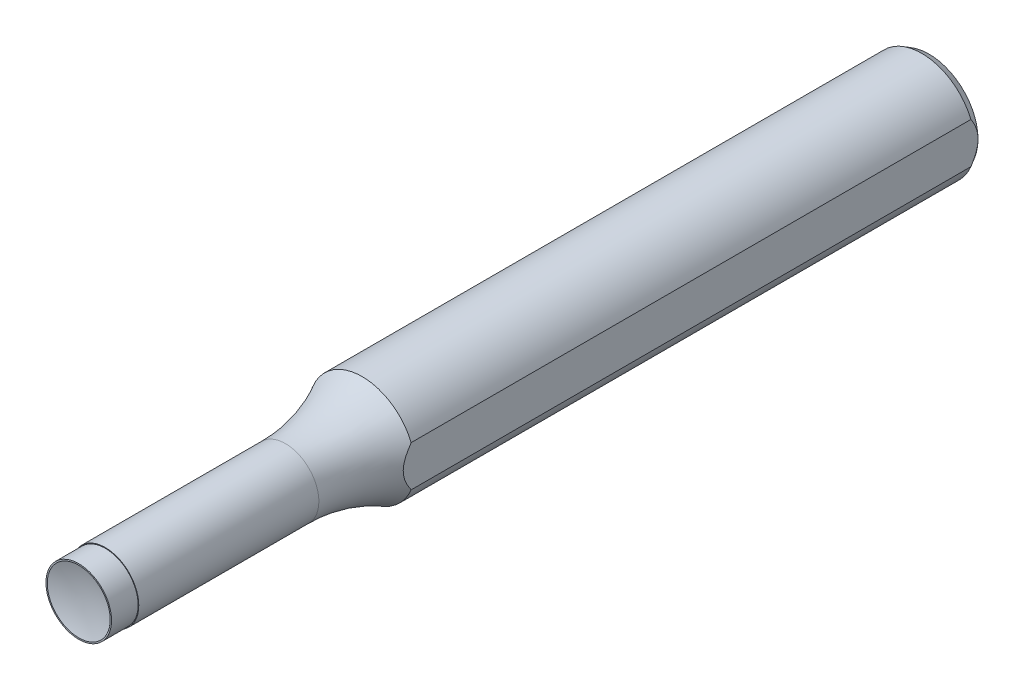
ISO-10303-21;
HEADER;
FILE_DESCRIPTION(('STEP AP214'),'2;1');
FILE_NAME('part.step','',(''),(''),'','','');
FILE_SCHEMA(('AUTOMOTIVE_DESIGN { 1 0 10303 214 1 1 1 1 }'));
ENDSEC;
DATA;
#1=APPLICATION_CONTEXT('core data for automotive mechanical design processes');
#2=APPLICATION_PROTOCOL_DEFINITION('international standard','automotive_design',2000,#1);
#3=PRODUCT_CONTEXT('',#1,'mechanical');
#4=PRODUCT('Part','Part','',(#3));
#5=PRODUCT_RELATED_PRODUCT_CATEGORY('part','',(#4));
#6=PRODUCT_DEFINITION_FORMATION('','',#4);
#7=PRODUCT_DEFINITION_CONTEXT('part definition',#1,'design');
#8=PRODUCT_DEFINITION('design','',#6,#7);
#9=PRODUCT_DEFINITION_SHAPE('','',#8);
#10=(LENGTH_UNIT() NAMED_UNIT(*) SI_UNIT(.MILLI.,.METRE.));
#11=(NAMED_UNIT(*) PLANE_ANGLE_UNIT() SI_UNIT($,.RADIAN.));
#12=(NAMED_UNIT(*) SI_UNIT($,.STERADIAN.) SOLID_ANGLE_UNIT());
#13=UNCERTAINTY_MEASURE_WITH_UNIT(LENGTH_MEASURE(1.E-05),#10,'distance_accuracy_value','');
#14=(GEOMETRIC_REPRESENTATION_CONTEXT(3) GLOBAL_UNCERTAINTY_ASSIGNED_CONTEXT((#13)) GLOBAL_UNIT_ASSIGNED_CONTEXT((#10,
#11,#12)) REPRESENTATION_CONTEXT('',''));
#15=CARTESIAN_POINT('',(0.,0.,0.));
#16=DIRECTION('',(0.,0.,1.));
#17=DIRECTION('',(1.,0.,0.));
#18=AXIS2_PLACEMENT_3D('',#15,#16,#17);
#19=CARTESIAN_POINT('',(0.,0.,-42.3333333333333));
#20=DIRECTION('',(0.,0.,1.));
#21=DIRECTION('',(1.,0.,0.));
#22=AXIS2_PLACEMENT_3D('',#19,#20,#21);
#23=CYLINDRICAL_SURFACE('',#22,5.);
#24=CARTESIAN_POINT('',(0.,0.,-30.8695643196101));
#25=DIRECTION('',(0.,0.,1.));
#26=DIRECTION('',(0.,-1.,0.));
#27=AXIS2_PLACEMENT_3D('',#24,#25,#26);
#28=CIRCLE('',#27,5.);
#29=CARTESIAN_POINT('',(0.,-5.,-30.8695643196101));
#30=VERTEX_POINT('',#29);
#31=EDGE_CURVE('E79',#30,#30,#28,.F.);
#32=ORIENTED_EDGE('',*,*,#31,.F.);
#33=EDGE_LOOP('',(#32));
#34=FACE_BOUND('',#33,.T.);
#35=CARTESIAN_POINT('',(0.,0.,-3.97));
#36=DIRECTION('',(0.,0.,1.));
#37=DIRECTION('',(1.,0.,0.));
#38=AXIS2_PLACEMENT_3D('',#35,#36,#37);
#39=CIRCLE('',#38,5.);
#40=CARTESIAN_POINT('',(5.,0.,-3.97));
#41=VERTEX_POINT('',#40);
#42=EDGE_CURVE('E90',#41,#41,#39,.F.);
#43=ORIENTED_EDGE('',*,*,#42,.T.);
#44=EDGE_LOOP('',(#43));
#45=FACE_BOUND('',#44,.T.);
#46=ADVANCED_FACE('F42',(#34,#45),#23,.T.);
#47=CARTESIAN_POINT('',(0.,0.,-3.97));
#48=DIRECTION('',(0.,0.,1.));
#49=DIRECTION('',(1.,0.,0.));
#50=AXIS2_PLACEMENT_3D('',#47,#48,#49);
#51=PLANE('',#50);
#52=ORIENTED_EDGE('',*,*,#42,.F.);
#53=EDGE_LOOP('',(#52));
#54=FACE_BOUND('',#53,.T.);
#55=CARTESIAN_POINT('',(0.,0.,-3.97));
#56=DIRECTION('',(0.,0.,1.));
#57=DIRECTION('',(1.,0.,0.));
#58=AXIS2_PLACEMENT_3D('',#55,#56,#57);
#59=CIRCLE('',#58,4.9);
#60=CARTESIAN_POINT('',(4.9,0.,-3.97));
#61=VERTEX_POINT('',#60);
#62=EDGE_CURVE('E98',#61,#61,#59,.T.);
#63=ORIENTED_EDGE('',*,*,#62,.F.);
#64=EDGE_LOOP('',(#63));
#65=FACE_BOUND('',#64,.T.);
#66=ADVANCED_FACE('F111',(#54,#65),#51,.T.);
#67=CARTESIAN_POINT('',(0.,0.,-3.97));
#68=DIRECTION('',(0.,0.,1.));
#69=DIRECTION('',(1.,0.,0.));
#70=AXIS2_PLACEMENT_3D('',#67,#68,#69);
#71=CYLINDRICAL_SURFACE('',#70,4.9);
#72=ORIENTED_EDGE('',*,*,#62,.T.);
#73=EDGE_LOOP('',(#72));
#74=FACE_BOUND('',#73,.T.);
#75=CARTESIAN_POINT('',(0.,0.,0.));
#76=DIRECTION('',(0.,0.,1.));
#77=DIRECTION('',(1.,0.,0.));
#78=AXIS2_PLACEMENT_3D('',#75,#76,#77);
#79=CIRCLE('',#78,4.9);
#80=CARTESIAN_POINT('',(4.9,0.,0.));
#81=VERTEX_POINT('',#80);
#82=EDGE_CURVE('E122',#81,#81,#79,.T.);
#83=ORIENTED_EDGE('',*,*,#82,.F.);
#84=EDGE_LOOP('',(#83));
#85=FACE_BOUND('',#84,.T.);
#86=ADVANCED_FACE('F117',(#74,#85),#71,.T.);
#87=CARTESIAN_POINT('',(0.,0.,0.));
#88=DIRECTION('',(0.,0.,1.));
#89=DIRECTION('',(1.,0.,0.));
#90=AXIS2_PLACEMENT_3D('',#87,#88,#89);
#91=PLANE('',#90);
#92=CARTESIAN_POINT('',(0.,0.,0.));
#93=DIRECTION('',(0.,0.,1.));
#94=DIRECTION('',(0.,-1.,0.));
#95=AXIS2_PLACEMENT_3D('',#92,#93,#94);
#96=CIRCLE('',#95,4.7);
#97=CARTESIAN_POINT('',(0.,-4.7,0.));
#98=VERTEX_POINT('',#97);
#99=EDGE_CURVE('E126',#98,#98,#96,.T.);
#100=ORIENTED_EDGE('',*,*,#99,.F.);
#101=EDGE_LOOP('',(#100));
#102=FACE_BOUND('',#101,.T.);
#103=ORIENTED_EDGE('',*,*,#82,.T.);
#104=EDGE_LOOP('',(#103));
#105=FACE_BOUND('',#104,.T.);
#106=ADVANCED_FACE('F157',(#102,#105),#91,.T.);
#107=CARTESIAN_POINT('',(0.,0.,15.1685332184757));
#108=DIRECTION('',(0.,0.,1.));
#109=DIRECTION('',(0.,-1.,0.));
#110=AXIS2_PLACEMENT_3D('',#107,#108,#109);
#111=SPHERICAL_SURFACE('',#110,15.88);
#112=ORIENTED_EDGE('',*,*,#99,.T.);
#113=EDGE_LOOP('',(#112));
#114=FACE_BOUND('',#113,.T.);
#115=ADVANCED_FACE('F160',(#114),#111,.F.);
#116=CARTESIAN_POINT('',(0.,0.,-30.8695643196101));
#117=DIRECTION('',(0.,0.,-1.));
#118=DIRECTION('',(0.,1.,0.));
#119=AXIS2_PLACEMENT_3D('',#116,#117,#118);
#120=TOROIDAL_SURFACE('',#119,28.82,23.82);
#121=CARTESIAN_POINT('',(7.32877851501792,16.0454516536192,-51.9028398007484));
#122=CARTESIAN_POINT('',(7.32877851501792,15.7495868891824,-51.7597994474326));
#123=CARTESIAN_POINT('',(7.32877851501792,15.4560685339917,-51.6119350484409));
#124=CARTESIAN_POINT('',(7.32877851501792,14.8738791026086,-51.3070150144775));
#125=CARTESIAN_POINT('',(7.32877851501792,14.5852075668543,-51.1499602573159));
#126=CARTESIAN_POINT('',(7.32877851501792,14.0130794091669,-50.8272410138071));
#127=CARTESIAN_POINT('',(7.32877851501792,13.7296181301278,-50.6615847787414));
#128=CARTESIAN_POINT('',(7.32877851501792,13.1676921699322,-50.3220159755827));
#129=CARTESIAN_POINT('',(7.32877851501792,12.8892275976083,-50.1481032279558));
#130=CARTESIAN_POINT('',(7.32877851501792,12.0672388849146,-49.6185163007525));
#131=CARTESIAN_POINT('',(7.32877851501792,11.5309659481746,-49.2514993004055));
#132=CARTESIAN_POINT('',(7.32877851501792,10.7406702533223,-48.6815621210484));
#133=CARTESIAN_POINT('',(7.32877851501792,10.4795599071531,-48.4883232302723));
#134=CARTESIAN_POINT('',(7.32877851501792,9.96175883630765,-48.0960028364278));
#135=CARTESIAN_POINT('',(7.32877851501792,9.70506808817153,-47.8969213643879));
#136=CARTESIAN_POINT('',(7.32877851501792,9.09926807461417,-47.4171987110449));
#137=CARTESIAN_POINT('',(7.32877851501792,8.75199772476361,-47.1342387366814));
#138=CARTESIAN_POINT('',(7.32877851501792,8.06388202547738,-46.5606926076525));
#139=CARTESIAN_POINT('',(7.32877851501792,7.72303627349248,-46.2701069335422));
#140=CARTESIAN_POINT('',(7.32877851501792,7.21437876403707,-45.830020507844));
#141=CARTESIAN_POINT('',(7.32877851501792,7.04496501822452,-45.6823595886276));
#142=CARTESIAN_POINT('',(7.32877851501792,6.70684504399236,-45.3862358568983));
#143=CARTESIAN_POINT('',(7.32877851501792,6.53813880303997,-45.2377730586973));
#144=CARTESIAN_POINT('',(7.32877851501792,6.20101799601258,-44.9405677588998));
#145=CARTESIAN_POINT('',(7.32877851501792,6.03260339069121,-44.7918253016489));
#146=CARTESIAN_POINT('',(7.32877851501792,5.69547952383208,-44.4946498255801));
#147=CARTESIAN_POINT('',(7.32877851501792,5.52677024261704,-44.3462168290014));
#148=CARTESIAN_POINT('',(7.32877851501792,5.12188932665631,-43.9922970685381));
#149=CARTESIAN_POINT('',(7.32877851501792,4.88527017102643,-43.7873210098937));
#150=CARTESIAN_POINT('',(7.32877851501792,4.40783518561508,-43.3823214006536));
#151=CARTESIAN_POINT('',(7.32877851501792,4.16702004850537,-43.1822970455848));
#152=CARTESIAN_POINT('',(7.32877851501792,3.80040115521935,-42.8895407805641));
#153=CARTESIAN_POINT('',(7.32877851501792,3.67743321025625,-42.793270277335));
#154=CARTESIAN_POINT('',(7.32877851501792,3.42908896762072,-42.6038964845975));
#155=CARTESIAN_POINT('',(7.32877851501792,3.30371289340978,-42.5107929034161));
#156=CARTESIAN_POINT('',(7.32877851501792,3.05006827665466,-42.3288464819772));
#157=CARTESIAN_POINT('',(7.32877851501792,2.92180257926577,-42.2399996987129));
#158=CARTESIAN_POINT('',(7.32877851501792,2.66163518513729,-42.067831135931));
#159=CARTESIAN_POINT('',(7.32877851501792,2.52973441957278,-41.9845079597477));
#160=CARTESIAN_POINT('',(7.32877851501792,2.28701623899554,-41.8402536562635));
#161=CARTESIAN_POINT('',(7.32877851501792,2.17694874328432,-41.7780741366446));
#162=CARTESIAN_POINT('',(7.32877851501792,1.95366816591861,-41.659690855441));
#163=CARTESIAN_POINT('',(7.32877851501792,1.84045469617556,-41.6034878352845));
#164=CARTESIAN_POINT('',(7.32877851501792,1.4959338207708,-41.4461432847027));
#165=CARTESIAN_POINT('',(7.32877851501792,1.25921016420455,-41.3559322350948));
#166=CARTESIAN_POINT('',(7.32877851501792,0.916842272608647,-41.2592031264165));
#167=CARTESIAN_POINT('',(7.32877851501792,0.8161768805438,-41.2346952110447));
#168=CARTESIAN_POINT('',(7.32877851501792,0.613221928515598,-41.1938436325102));
#169=CARTESIAN_POINT('',(7.32877851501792,0.510933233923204,-41.1774957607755));
#170=CARTESIAN_POINT('',(7.32877851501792,0.305403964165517,-41.153654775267));
#171=CARTESIAN_POINT('',(7.32877851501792,0.202164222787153,-41.1461545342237));
#172=CARTESIAN_POINT('',(7.32877851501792,-0.0045788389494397,-41.14032604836));
#173=CARTESIAN_POINT('',(7.32877851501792,-0.108082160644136,-41.1419978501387));
#174=CARTESIAN_POINT('',(7.32877851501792,-0.314460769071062,-41.1544315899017));
#175=CARTESIAN_POINT('',(7.32877851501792,-0.41733644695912,-41.1651871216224));
#176=CARTESIAN_POINT('',(7.32877851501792,-0.621823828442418,-41.1953014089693));
#177=CARTESIAN_POINT('',(7.32877851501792,-0.723435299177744,-41.2146617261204));
#178=CARTESIAN_POINT('',(7.32877851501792,-0.924892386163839,-41.2612224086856));
#179=CARTESIAN_POINT('',(7.32877851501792,-1.02473689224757,-41.2884275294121));
#180=CARTESIAN_POINT('',(7.32877851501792,-1.22226017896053,-41.3497390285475));
#181=CARTESIAN_POINT('',(7.32877851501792,-1.31993887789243,-41.3838456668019));
#182=CARTESIAN_POINT('',(7.32877851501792,-1.63539835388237,-41.5049982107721));
#183=CARTESIAN_POINT('',(7.32877851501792,-1.84846784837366,-41.6043466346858));
#184=CARTESIAN_POINT('',(7.32877851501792,-2.26375847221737,-41.8236856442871));
#185=CARTESIAN_POINT('',(7.32877851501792,-2.46595824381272,-41.9437150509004));
#186=CARTESIAN_POINT('',(7.32877851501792,-2.76357665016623,-42.1345497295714));
#187=CARTESIAN_POINT('',(7.32877851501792,-2.86229922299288,-42.2003042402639));
#188=CARTESIAN_POINT('',(7.32877851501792,-3.05779796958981,-42.3346539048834));
#189=CARTESIAN_POINT('',(7.32877851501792,-3.15457409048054,-42.4032491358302));
#190=CARTESIAN_POINT('',(7.32877851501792,-3.34637293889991,-42.5426635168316));
#191=CARTESIAN_POINT('',(7.32877851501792,-3.44139713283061,-42.6134806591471));
#192=CARTESIAN_POINT('',(7.32877851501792,-3.6300304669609,-42.756959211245));
#193=CARTESIAN_POINT('',(7.32877851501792,-3.72363969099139,-42.8296205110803));
#194=CARTESIAN_POINT('',(7.32877851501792,-4.01999847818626,-43.0634528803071));
#195=CARTESIAN_POINT('',(7.32877851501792,-4.22054521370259,-43.227411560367));
#196=CARTESIAN_POINT('',(7.32877851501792,-4.61810816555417,-43.5595655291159));
#197=CARTESIAN_POINT('',(7.32877851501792,-4.81512386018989,-43.7277614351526));
#198=CARTESIAN_POINT('',(7.32877851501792,-5.20722814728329,-44.0665402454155));
#199=CARTESIAN_POINT('',(7.32877851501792,-5.40231590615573,-44.2371241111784));
#200=CARTESIAN_POINT('',(7.32877851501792,-5.79167446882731,-44.5792225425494));
#201=CARTESIAN_POINT('',(7.32877851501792,-5.98594526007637,-44.750737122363));
#202=CARTESIAN_POINT('',(7.32877851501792,-6.37481691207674,-45.093847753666));
#203=CARTESIAN_POINT('',(7.32877851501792,-6.56941789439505,-45.2654436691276));
#204=CARTESIAN_POINT('',(7.32877851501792,-6.95944403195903,-45.607700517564));
#205=CARTESIAN_POINT('',(7.32877851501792,-7.15486919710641,-45.7783614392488));
#206=CARTESIAN_POINT('',(7.32877851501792,-7.74316620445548,-46.2878232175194));
#207=CARTESIAN_POINT('',(7.32877851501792,-8.13816106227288,-46.6241939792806));
#208=CARTESIAN_POINT('',(7.32877851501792,-8.93309023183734,-47.2829892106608));
#209=CARTESIAN_POINT('',(7.32877851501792,-9.33293698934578,-47.6055187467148));
#210=CARTESIAN_POINT('',(7.32877851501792,-10.1432789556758,-48.2370601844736));
#211=CARTESIAN_POINT('',(7.32877851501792,-10.5537752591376,-48.546070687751));
#212=CARTESIAN_POINT('',(7.32877851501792,-11.3862072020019,-49.1477555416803));
#213=CARTESIAN_POINT('',(7.32877851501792,-11.8081354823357,-49.4404400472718));
#214=CARTESIAN_POINT('',(7.32877851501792,-12.6641255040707,-50.0074080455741));
#215=CARTESIAN_POINT('',(7.32877851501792,-13.0981849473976,-50.2816949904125));
#216=CARTESIAN_POINT('',(7.32877851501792,-13.7413293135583,-50.6676071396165));
#217=CARTESIAN_POINT('',(7.32877851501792,-13.9456318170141,-50.7872535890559));
#218=CARTESIAN_POINT('',(7.32877851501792,-14.3567912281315,-51.0220331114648));
#219=CARTESIAN_POINT('',(7.32877851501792,-14.5636478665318,-51.1371666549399));
#220=CARTESIAN_POINT('',(7.32877851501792,-14.9814992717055,-51.3636264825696));
#221=CARTESIAN_POINT('',(7.32877851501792,-15.1925136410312,-51.4749166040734));
#222=CARTESIAN_POINT('',(7.32877851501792,-15.6170915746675,-51.6925983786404));
#223=CARTESIAN_POINT('',(7.32877851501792,-15.8306554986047,-51.7989893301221));
#224=CARTESIAN_POINT('',(7.32877851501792,-16.0454516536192,-51.9028398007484));
#225=B_SPLINE_CURVE_WITH_KNOTS('',3,(#121,#122,#123,#124,#125,#126,#127,#128,#129,#130,#131,
#132,#133,#134,#135,#136,#137,#138,#139,#140,#141,#142,#143,#144,#145,#146,#147,#148,#149,#150,
#151,#152,#153,#154,#155,#156,#157,#158,#159,#160,#161,#162,#163,#164,#165,#166,#167,#168,#169,
#170,#171,#172,#173,#174,#175,#176,#177,#178,#179,#180,#181,#182,#183,#184,#185,#186,#187,#188,
#189,#190,#191,#192,#193,#194,#195,#196,#197,#198,#199,#200,#201,#202,#203,#204,#205,#206,#207,
#208,#209,#210,#211,#212,#213,#214,#215,#216,#217,#218,#219,#220,#221,#222,#223,#224),
.UNSPECIFIED.,.F.,.F.,(4,2,2,2,2,2,2,2,2,2,2,2,2,2,2,2,2,2,2,2,2,2,2,2,2,2,2,2,2,2,2,2,2,2,2,2,
2,2,2,2,2,2,2,2,2,2,2,2,2,2,2,4),(0.,0.985821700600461,1.97154939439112,2.9563483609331,
3.94116875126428,5.88961011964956,6.86406659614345,7.83851789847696,9.18223108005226,
10.5258597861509,11.2000561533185,11.8742405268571,12.5483257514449,13.2224578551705,
14.1616087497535,15.1006060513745,15.5690789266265,16.0375085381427,16.5054955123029,
16.9733636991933,17.3524314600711,17.7315461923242,18.4878908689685,18.798440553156,
19.1088299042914,19.4189690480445,19.7291097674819,20.0390319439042,20.3490103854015,
20.6591771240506,20.9693555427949,21.6727199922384,22.3774194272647,22.7332268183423,
23.0890438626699,23.4445481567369,23.8000313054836,24.577032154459,25.3541468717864,
26.1315840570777,26.9090331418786,27.687383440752,28.4657431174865,30.0220537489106,
31.5629641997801,33.1040336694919,34.6441336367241,36.1839438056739,36.8941748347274,
37.6043316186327,38.3199592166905,39.0356889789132),.UNSPECIFIED.);
#226=CARTESIAN_POINT('',(7.32877851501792,3.05493133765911,-42.3333333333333));
#227=VERTEX_POINT('',#226);
#228=CARTESIAN_POINT('',(7.32877851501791,-3.0549313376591,-42.3333333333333));
#229=VERTEX_POINT('',#228);
#230=EDGE_CURVE('E58',#227,#229,#225,.T.);
#231=ORIENTED_EDGE('',*,*,#230,.F.);
#232=CARTESIAN_POINT('',(0.,0.,-42.3333333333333));
#233=DIRECTION('',(0.,0.,-1.));
#234=DIRECTION('',(0.,1.,0.));
#235=AXIS2_PLACEMENT_3D('',#232,#233,#234);
#236=CIRCLE('',#235,7.93999999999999);
#237=EDGE_CURVE('E131',#229,#227,#236,.T.);
#238=ORIENTED_EDGE('',*,*,#237,.F.);
#239=EDGE_LOOP('',(#231,#238));
#240=FACE_BOUND('',#239,.T.);
#241=ORIENTED_EDGE('',*,*,#31,.T.);
#242=EDGE_LOOP('',(#241));
#243=FACE_BOUND('',#242,.T.);
#244=ADVANCED_FACE('F107',(#240,#243),#120,.F.);
#245=CARTESIAN_POINT('',(0.,0.,-127.));
#246=DIRECTION('',(0.,0.,1.));
#247=DIRECTION('',(1.,0.,0.));
#248=AXIS2_PLACEMENT_3D('',#245,#246,#247);
#249=PLANE('',#248);
#250=CARTESIAN_POINT('',(0.,0.,-127.));
#251=DIRECTION('',(0.,0.,1.));
#252=DIRECTION('',(1.,0.,0.));
#253=AXIS2_PLACEMENT_3D('',#250,#251,#252);
#254=CIRCLE('',#253,7.32877851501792);
#255=CARTESIAN_POINT('',(7.32877851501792,0.,-127.));
#256=VERTEX_POINT('',#255);
#257=EDGE_CURVE('E85',#256,#256,#254,.F.);
#258=ORIENTED_EDGE('',*,*,#257,.T.);
#259=EDGE_LOOP('',(#258));
#260=FACE_BOUND('',#259,.T.);
#261=ADVANCED_FACE('F155',(#260),#249,.F.);
#262=CARTESIAN_POINT('',(0.,0.,-125.941333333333));
#263=DIRECTION('',(0.,0.,1.));
#264=DIRECTION('',(1.,0.,0.));
#265=AXIS2_PLACEMENT_3D('',#262,#263,#264);
#266=CONICAL_SURFACE('',#265,7.94,0.523598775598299);
#267=CARTESIAN_POINT('',(7.32877851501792,-8.88843113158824,-119.740230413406));
#268=CARTESIAN_POINT('',(7.32877851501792,-8.73080406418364,-119.950851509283));
#269=CARTESIAN_POINT('',(7.32877851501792,-8.57211012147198,-120.160681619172));
#270=CARTESIAN_POINT('',(7.32877851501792,-8.2522191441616,-120.578457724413));
#271=CARTESIAN_POINT('',(7.32877851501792,-8.09102185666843,-120.786403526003));
#272=CARTESIAN_POINT('',(7.32877851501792,-7.76533800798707,-121.200636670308));
#273=CARTESIAN_POINT('',(7.32877851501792,-7.60084359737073,-121.406917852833));
#274=CARTESIAN_POINT('',(7.32877851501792,-7.26855482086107,-121.816797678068));
#275=CARTESIAN_POINT('',(7.32877851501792,-7.10076056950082,-122.020396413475));
#276=CARTESIAN_POINT('',(7.32877851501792,-6.75953587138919,-122.426496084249));
#277=CARTESIAN_POINT('',(7.32877851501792,-6.5860646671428,-122.628962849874));
#278=CARTESIAN_POINT('',(7.32877851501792,-6.2345106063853,-123.029849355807));
#279=CARTESIAN_POINT('',(7.32877851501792,-6.05642794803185,-123.228269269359));
#280=CARTESIAN_POINT('',(7.32877851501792,-5.69497835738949,-123.619871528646));
#281=CARTESIAN_POINT('',(7.32877851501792,-5.51161708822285,-123.813059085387));
#282=CARTESIAN_POINT('',(7.32877851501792,-5.13840554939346,-124.193037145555));
#283=CARTESIAN_POINT('',(7.32877851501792,-4.94855643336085,-124.379828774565));
#284=CARTESIAN_POINT('',(7.32877851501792,-4.6185619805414,-124.690909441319));
#285=CARTESIAN_POINT('',(7.32877851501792,-4.48039232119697,-124.817291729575));
#286=CARTESIAN_POINT('',(7.32877851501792,-4.19962787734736,-125.065084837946));
#287=CARTESIAN_POINT('',(7.32877851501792,-4.05703278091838,-125.186495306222));
#288=CARTESIAN_POINT('',(7.32877851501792,-3.76656482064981,-125.423404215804));
#289=CARTESIAN_POINT('',(7.32877851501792,-3.6186830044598,-125.538891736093));
#290=CARTESIAN_POINT('',(7.32877851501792,-3.31722208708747,-125.762227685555));
#291=CARTESIAN_POINT('',(7.32877851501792,-3.16364295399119,-125.870076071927));
#292=CARTESIAN_POINT('',(7.32877851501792,-2.8476171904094,-126.077847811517));
#293=CARTESIAN_POINT('',(7.32877851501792,-2.68506781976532,-126.177616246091));
#294=CARTESIAN_POINT('',(7.32877851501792,-2.3528177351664,-126.364667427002));
#295=CARTESIAN_POINT('',(7.32877851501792,-2.18311574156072,-126.451947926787));
#296=CARTESIAN_POINT('',(7.32877851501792,-1.83724775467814,-126.610376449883));
#297=CARTESIAN_POINT('',(7.32877851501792,-1.66111710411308,-126.681600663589));
#298=CARTESIAN_POINT('',(7.32877851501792,-1.3022419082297,-126.804750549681));
#299=CARTESIAN_POINT('',(7.32877851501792,-1.11950321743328,-126.856692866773));
#300=CARTESIAN_POINT('',(7.32877851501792,-0.813030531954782,-126.923831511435));
#301=CARTESIAN_POINT('',(7.32877851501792,-0.690702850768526,-126.945522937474));
#302=CARTESIAN_POINT('',(7.32877851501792,-0.444657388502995,-126.978429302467));
#303=CARTESIAN_POINT('',(7.32877851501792,-0.320940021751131,-126.989647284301));
#304=CARTESIAN_POINT('',(7.32877851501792,-0.073012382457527,-127.001184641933));
#305=CARTESIAN_POINT('',(7.32877851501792,0.0511978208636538,-127.001505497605));
#306=CARTESIAN_POINT('',(7.32877851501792,0.299168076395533,-126.991242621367));
#307=CARTESIAN_POINT('',(7.32877851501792,0.422928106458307,-126.980658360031));
#308=CARTESIAN_POINT('',(7.32877851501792,0.668575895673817,-126.949047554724));
#309=CARTESIAN_POINT('',(7.32877851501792,0.790469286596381,-126.928064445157));
#310=CARTESIAN_POINT('',(7.32877851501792,1.03220206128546,-126.876404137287));
#311=CARTESIAN_POINT('',(7.32877851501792,1.15204057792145,-126.845722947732));
#312=CARTESIAN_POINT('',(7.32877851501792,1.50769171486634,-126.740480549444));
#313=CARTESIAN_POINT('',(7.32877851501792,1.73965666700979,-126.652718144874));
#314=CARTESIAN_POINT('',(7.32877851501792,2.17012243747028,-126.45964290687));
#315=CARTESIAN_POINT('',(7.32877851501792,2.36973261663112,-126.356709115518));
#316=CARTESIAN_POINT('',(7.32877851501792,2.75934848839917,-126.133817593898));
#317=CARTESIAN_POINT('',(7.32877851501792,2.9493454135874,-126.0138446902));
#318=CARTESIAN_POINT('',(7.32877851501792,3.32222206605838,-125.759850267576));
#319=CARTESIAN_POINT('',(7.32877851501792,3.50501774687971,-125.625706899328));
#320=CARTESIAN_POINT('',(7.32877851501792,3.86268505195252,-125.347474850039));
#321=CARTESIAN_POINT('',(7.32877851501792,4.03755997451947,-125.203390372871));
#322=CARTESIAN_POINT('',(7.32877851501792,4.43901655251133,-124.857102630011));
#323=CARTESIAN_POINT('',(7.32877851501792,4.66292739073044,-124.65181624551));
#324=CARTESIAN_POINT('',(7.32877851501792,5.10105623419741,-124.231095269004));
#325=CARTESIAN_POINT('',(7.32877851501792,5.31527068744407,-124.015657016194));
#326=CARTESIAN_POINT('',(7.32877851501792,5.73618445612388,-123.576758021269));
#327=CARTESIAN_POINT('',(7.32877851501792,5.94286768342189,-123.353281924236));
#328=CARTESIAN_POINT('',(7.32877851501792,6.34971215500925,-122.90046420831));
#329=CARTESIAN_POINT('',(7.32877851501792,6.54987289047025,-122.671122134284));
#330=CARTESIAN_POINT('',(7.32877851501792,6.93408307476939,-122.220381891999));
#331=CARTESIAN_POINT('',(7.32877851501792,7.11841797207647,-121.999226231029));
#332=CARTESIAN_POINT('',(7.32877851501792,7.48300213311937,-121.553559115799));
#333=CARTESIAN_POINT('',(7.32877851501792,7.66325117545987,-121.329047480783));
#334=CARTESIAN_POINT('',(7.32877851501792,8.01935572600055,-120.878424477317));
#335=CARTESIAN_POINT('',(7.32877851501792,8.1952289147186,-120.652327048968));
#336=CARTESIAN_POINT('',(7.32877851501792,8.54396458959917,-120.197873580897));
#337=CARTESIAN_POINT('',(7.32877851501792,8.71682751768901,-119.969517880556));
#338=CARTESIAN_POINT('',(7.32877851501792,8.88843113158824,-119.740230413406));
#339=B_SPLINE_CURVE_WITH_KNOTS('',3,(#267,#268,#269,#270,#271,#272,#273,#274,#275,#276,#277,
#278,#279,#280,#281,#282,#283,#284,#285,#286,#287,#288,#289,#290,#291,#292,#293,#294,#295,#296,
#297,#298,#299,#300,#301,#302,#303,#304,#305,#306,#307,#308,#309,#310,#311,#312,#313,#314,#315,
#316,#317,#318,#319,#320,#321,#322,#323,#324,#325,#326,#327,#328,#329,#330,#331,#332,#333,#334,
#335,#336,#337,#338),.UNSPECIFIED.,.F.,.F.,(4,2,2,2,2,2,2,2,2,2,2,2,2,2,2,2,2,2,2,2,2,2,2,2,2,2,
2,2,2,2,2,2,2,2,2,4),(0.,0.789225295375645,1.57853084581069,2.37001454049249,3.16147081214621,
3.96126621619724,4.76102730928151,5.55996020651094,6.35875177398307,6.92041249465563,
7.48211289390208,8.04481426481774,8.60751878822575,9.17925174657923,9.75108742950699,
10.3201496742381,10.8887195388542,11.2610272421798,11.6332267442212,12.0053756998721,
12.3775427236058,12.7481682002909,13.118946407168,13.8604526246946,14.5332661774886,
15.2066826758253,15.8864517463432,16.5659350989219,17.4768018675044,18.3879996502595,
19.3010416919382,20.2141547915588,21.0778126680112,21.9415172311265,22.8008298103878,
23.6600151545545),.UNSPECIFIED.);
#340=CARTESIAN_POINT('',(7.32877851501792,-3.05493133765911,-125.941333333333));
#341=VERTEX_POINT('',#340);
#342=EDGE_CURVE('E73',#341,#256,#339,.T.);
#343=ORIENTED_EDGE('',*,*,#342,.F.);
#344=CARTESIAN_POINT('',(0.,0.,-125.941333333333));
#345=DIRECTION('',(0.,0.,1.));
#346=DIRECTION('',(1.,0.,0.));
#347=AXIS2_PLACEMENT_3D('',#344,#345,#346);
#348=CIRCLE('',#347,7.94);
#349=CARTESIAN_POINT('',(7.32877851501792,3.05493133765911,-125.941333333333));
#350=VERTEX_POINT('',#349);
#351=EDGE_CURVE('E83',#350,#341,#348,.T.);
#352=ORIENTED_EDGE('',*,*,#351,.F.);
#353=EDGE_CURVE('E64',#256,#350,#339,.T.);
#354=ORIENTED_EDGE('',*,*,#353,.F.);
#355=ORIENTED_EDGE('',*,*,#257,.F.);
#356=EDGE_LOOP('',(#343,#352,#354,#355));
#357=FACE_BOUND('',#356,.T.);
#358=ADVANCED_FACE('F44',(#357),#266,.T.);
#359=CARTESIAN_POINT('',(0.,0.,-127.));
#360=DIRECTION('',(0.,0.,1.));
#361=DIRECTION('',(1.,0.,0.));
#362=AXIS2_PLACEMENT_3D('',#359,#360,#361);
#363=CYLINDRICAL_SURFACE('',#362,7.94);
#364=DIRECTION('',(0.,0.,1.));
#365=VECTOR('',#364,1.);
#366=CARTESIAN_POINT('',(7.32877851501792,3.05493133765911,-127.));
#367=LINE('',#366,#365);
#368=EDGE_CURVE('E13',#350,#227,#367,.T.);
#369=ORIENTED_EDGE('',*,*,#368,.F.);
#370=ORIENTED_EDGE('',*,*,#351,.T.);
#371=DIRECTION('',(0.,0.,1.));
#372=VECTOR('',#371,1.);
#373=CARTESIAN_POINT('',(7.32877851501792,-3.05493133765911,-127.));
#374=LINE('',#373,#372);
#375=EDGE_CURVE('E52',#229,#341,#374,.F.);
#376=ORIENTED_EDGE('',*,*,#375,.F.);
#377=ORIENTED_EDGE('',*,*,#237,.T.);
#378=EDGE_LOOP('',(#369,#370,#376,#377));
#379=FACE_BOUND('',#378,.T.);
#380=ADVANCED_FACE('F88',(#379),#363,.T.);
#381=CARTESIAN_POINT('',(7.32877851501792,3.05493133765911,0.));
#382=DIRECTION('',(-1.,0.,0.));
#383=DIRECTION('',(0.,0.,1.));
#384=AXIS2_PLACEMENT_3D('',#381,#382,#383);
#385=PLANE('',#384);
#386=ORIENTED_EDGE('',*,*,#230,.T.);
#387=ORIENTED_EDGE('',*,*,#375,.T.);
#388=ORIENTED_EDGE('',*,*,#342,.T.);
#389=ORIENTED_EDGE('',*,*,#353,.T.);
#390=ORIENTED_EDGE('',*,*,#368,.T.);
#391=EDGE_LOOP('',(#386,#387,#388,#389,#390));
#392=FACE_BOUND('',#391,.T.);
#393=ADVANCED_FACE('F72',(#392),#385,.F.);
#394=CLOSED_SHELL('',(#46,#66,#86,#106,#115,#244,#261,#358,#380,#393));
#395=MANIFOLD_SOLID_BREP('B2',#394);
#396=ADVANCED_BREP_SHAPE_REPRESENTATION('',(#18,#395),#14);
#397=SHAPE_DEFINITION_REPRESENTATION(#9,#396);
ENDSEC;
END-ISO-10303-21;
